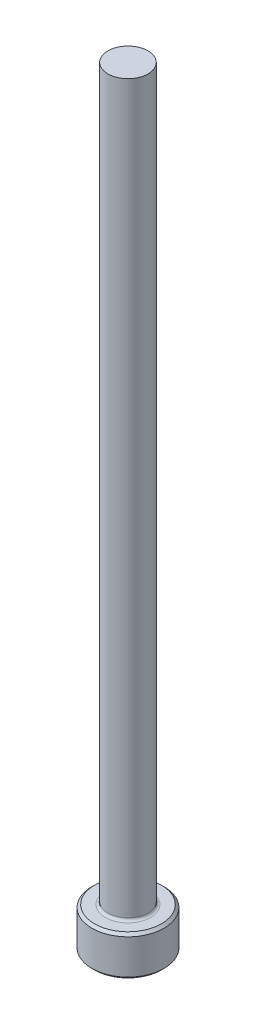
ISO-10303-21;
HEADER;
FILE_DESCRIPTION(('STEP AP214'),'2;1');
FILE_NAME('part.step','',(''),(''),'','','');
FILE_SCHEMA(('AUTOMOTIVE_DESIGN { 1 0 10303 214 1 1 1 1 }'));
ENDSEC;
DATA;
#1=APPLICATION_CONTEXT('core data for automotive mechanical design processes');
#2=APPLICATION_PROTOCOL_DEFINITION('international standard','automotive_design',2000,#1);
#3=PRODUCT_CONTEXT('',#1,'mechanical');
#4=PRODUCT('Part','Part','',(#3));
#5=PRODUCT_RELATED_PRODUCT_CATEGORY('part','',(#4));
#6=PRODUCT_DEFINITION_FORMATION('','',#4);
#7=PRODUCT_DEFINITION_CONTEXT('part definition',#1,'design');
#8=PRODUCT_DEFINITION('design','',#6,#7);
#9=PRODUCT_DEFINITION_SHAPE('','',#8);
#10=(LENGTH_UNIT() NAMED_UNIT(*) SI_UNIT(.MILLI.,.METRE.));
#11=(NAMED_UNIT(*) PLANE_ANGLE_UNIT() SI_UNIT($,.RADIAN.));
#12=(NAMED_UNIT(*) SI_UNIT($,.STERADIAN.) SOLID_ANGLE_UNIT());
#13=UNCERTAINTY_MEASURE_WITH_UNIT(LENGTH_MEASURE(1.E-05),#10,'distance_accuracy_value','');
#14=(GEOMETRIC_REPRESENTATION_CONTEXT(3) GLOBAL_UNCERTAINTY_ASSIGNED_CONTEXT((#13)) GLOBAL_UNIT_ASSIGNED_CONTEXT((#10,
#11,#12)) REPRESENTATION_CONTEXT('',''));
#15=CARTESIAN_POINT('',(0.,0.,0.));
#16=DIRECTION('',(0.,0.,1.));
#17=DIRECTION('',(1.,0.,0.));
#18=AXIS2_PLACEMENT_3D('',#15,#16,#17);
#19=CARTESIAN_POINT('',(0.,0.,0.));
#20=DIRECTION('',(0.,-1.,0.));
#21=DIRECTION('',(0.,0.,-1.));
#22=AXIS2_PLACEMENT_3D('',#19,#20,#21);
#23=PLANE('',#22);
#24=CARTESIAN_POINT('',(0.,0.,0.));
#25=DIRECTION('',(0.,-1.,0.));
#26=DIRECTION('',(0.,0.,-1.));
#27=AXIS2_PLACEMENT_3D('',#24,#25,#26);
#28=CIRCLE('',#27,3.3147);
#29=CARTESIAN_POINT('',(0.,0.,-3.3147));
#30=VERTEX_POINT('',#29);
#31=EDGE_CURVE('E46',#30,#30,#28,.T.);
#32=ORIENTED_EDGE('',*,*,#31,.T.);
#33=EDGE_LOOP('',(#32));
#34=FACE_BOUND('',#33,.T.);
#35=ADVANCED_FACE('F35',(#34),#23,.T.);
#36=CARTESIAN_POINT('',(0.,259.958771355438,0.));
#37=DIRECTION('',(0.,1.,0.));
#38=DIRECTION('',(0.,0.,1.));
#39=AXIS2_PLACEMENT_3D('',#36,#37,#38);
#40=CYLINDRICAL_SURFACE('',#39,3.56869999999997);
#41=CARTESIAN_POINT('',(0.,3.7084,0.));
#42=DIRECTION('',(0.,1.,0.));
#43=DIRECTION('',(0.,0.,1.));
#44=AXIS2_PLACEMENT_3D('',#41,#42,#43);
#45=CIRCLE('',#44,3.56869999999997);
#46=CARTESIAN_POINT('',(0.,3.7084,3.56869999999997));
#47=VERTEX_POINT('',#46);
#48=EDGE_CURVE('E50',#47,#47,#45,.F.);
#49=ORIENTED_EDGE('',*,*,#48,.T.);
#50=EDGE_LOOP('',(#49));
#51=FACE_BOUND('',#50,.T.);
#52=CARTESIAN_POINT('',(0.,0.253999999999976,0.));
#53=DIRECTION('',(0.,-1.,0.));
#54=DIRECTION('',(0.,0.,-1.));
#55=AXIS2_PLACEMENT_3D('',#52,#53,#54);
#56=CIRCLE('',#55,3.56869999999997);
#57=CARTESIAN_POINT('',(0.,0.253999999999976,-3.56869999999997));
#58=VERTEX_POINT('',#57);
#59=EDGE_CURVE('E55',#58,#58,#56,.F.);
#60=ORIENTED_EDGE('',*,*,#59,.T.);
#61=EDGE_LOOP('',(#60));
#62=FACE_BOUND('',#61,.T.);
#63=ADVANCED_FACE('F77',(#51,#62),#40,.T.);
#64=CARTESIAN_POINT('',(-3.56869999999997,3.9624,0.));
#65=DIRECTION('',(0.,1.,0.));
#66=DIRECTION('',(0.,0.,1.));
#67=AXIS2_PLACEMENT_3D('',#64,#65,#66);
#68=PLANE('',#67);
#69=CARTESIAN_POINT('',(0.,3.9624,0.));
#70=DIRECTION('',(0.,1.,0.));
#71=DIRECTION('',(0.,0.,1.));
#72=AXIS2_PLACEMENT_3D('',#69,#70,#71);
#73=CIRCLE('',#72,2.23773999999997);
#74=CARTESIAN_POINT('',(0.,3.9624,2.23773999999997));
#75=VERTEX_POINT('',#74);
#76=EDGE_CURVE('E10',#75,#75,#73,.F.);
#77=ORIENTED_EDGE('',*,*,#76,.T.);
#78=EDGE_LOOP('',(#77));
#79=FACE_BOUND('',#78,.T.);
#80=CARTESIAN_POINT('',(0.,3.9624,0.));
#81=DIRECTION('',(0.,1.,0.));
#82=DIRECTION('',(0.,0.,1.));
#83=AXIS2_PLACEMENT_3D('',#80,#81,#82);
#84=CIRCLE('',#83,3.31469999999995);
#85=CARTESIAN_POINT('',(0.,3.9624,3.31469999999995));
#86=VERTEX_POINT('',#85);
#87=EDGE_CURVE('E58',#86,#86,#84,.T.);
#88=ORIENTED_EDGE('',*,*,#87,.T.);
#89=EDGE_LOOP('',(#88));
#90=FACE_BOUND('',#89,.T.);
#91=ADVANCED_FACE('F69',(#79,#90),#68,.T.);
#92=CARTESIAN_POINT('',(0.,259.958771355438,0.));
#93=DIRECTION('',(0.,1.,0.));
#94=DIRECTION('',(0.,0.,1.));
#95=AXIS2_PLACEMENT_3D('',#92,#93,#94);
#96=CYLINDRICAL_SURFACE('',#95,1.98373999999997);
#97=CARTESIAN_POINT('',(0.,4.21640000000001,0.));
#98=DIRECTION('',(0.,1.,0.));
#99=DIRECTION('',(0.,0.,1.));
#100=AXIS2_PLACEMENT_3D('',#97,#98,#99);
#101=CIRCLE('',#100,1.98373999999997);
#102=CARTESIAN_POINT('',(0.,4.21640000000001,1.98373999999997));
#103=VERTEX_POINT('',#102);
#104=EDGE_CURVE('E42',#103,#103,#101,.T.);
#105=ORIENTED_EDGE('',*,*,#104,.T.);
#106=EDGE_LOOP('',(#105));
#107=FACE_BOUND('',#106,.T.);
#108=CARTESIAN_POINT('',(0.,76.2,0.));
#109=DIRECTION('',(0.,1.,0.));
#110=DIRECTION('',(0.,0.,1.));
#111=AXIS2_PLACEMENT_3D('',#108,#109,#110);
#112=CIRCLE('',#111,1.98373999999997);
#113=CARTESIAN_POINT('',(0.,76.2,1.98373999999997));
#114=VERTEX_POINT('',#113);
#115=EDGE_CURVE('E61',#114,#114,#112,.T.);
#116=ORIENTED_EDGE('',*,*,#115,.F.);
#117=EDGE_LOOP('',(#116));
#118=FACE_BOUND('',#117,.T.);
#119=ADVANCED_FACE('F67',(#107,#118),#96,.T.);
#120=CARTESIAN_POINT('',(-1.98373999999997,76.2,0.));
#121=DIRECTION('',(0.,1.,0.));
#122=DIRECTION('',(0.,0.,1.));
#123=AXIS2_PLACEMENT_3D('',#120,#121,#122);
#124=PLANE('',#123);
#125=ORIENTED_EDGE('',*,*,#115,.T.);
#126=EDGE_LOOP('',(#125));
#127=FACE_BOUND('',#126,.T.);
#128=ADVANCED_FACE('F65',(#127),#124,.T.);
#129=CARTESIAN_POINT('',(0.,3.96239999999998,0.));
#130=DIRECTION('',(0.,-1.,0.));
#131=DIRECTION('',(0.,0.,-1.));
#132=AXIS2_PLACEMENT_3D('',#129,#130,#131);
#133=CONICAL_SURFACE('',#132,3.31469999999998,0.78539816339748);
#134=ORIENTED_EDGE('',*,*,#48,.F.);
#135=EDGE_LOOP('',(#134));
#136=FACE_BOUND('',#135,.T.);
#137=ORIENTED_EDGE('',*,*,#87,.F.);
#138=EDGE_LOOP('',(#137));
#139=FACE_BOUND('',#138,.T.);
#140=ADVANCED_FACE('F75',(#136,#139),#133,.T.);
#141=CARTESIAN_POINT('',(0.,0.253999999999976,0.));
#142=DIRECTION('',(0.,1.,0.));
#143=DIRECTION('',(0.,0.,1.));
#144=AXIS2_PLACEMENT_3D('',#141,#142,#143);
#145=CONICAL_SURFACE('',#144,3.56869999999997,0.785398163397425);
#146=ORIENTED_EDGE('',*,*,#31,.F.);
#147=EDGE_LOOP('',(#146));
#148=FACE_BOUND('',#147,.T.);
#149=ORIENTED_EDGE('',*,*,#59,.F.);
#150=EDGE_LOOP('',(#149));
#151=FACE_BOUND('',#150,.T.);
#152=ADVANCED_FACE('F89',(#148,#151),#145,.T.);
#153=CARTESIAN_POINT('',(0.,4.21640000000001,0.));
#154=DIRECTION('',(0.,1.,0.));
#155=DIRECTION('',(0.,0.,1.));
#156=AXIS2_PLACEMENT_3D('',#153,#154,#155);
#157=TOROIDAL_SURFACE('',#156,2.23773999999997,0.254);
#158=ORIENTED_EDGE('',*,*,#76,.F.);
#159=EDGE_LOOP('',(#158));
#160=FACE_BOUND('',#159,.T.);
#161=ORIENTED_EDGE('',*,*,#104,.F.);
#162=EDGE_LOOP('',(#161));
#163=FACE_BOUND('',#162,.T.);
#164=ADVANCED_FACE('F37',(#160,#163),#157,.F.);
#165=CLOSED_SHELL('',(#35,#63,#91,#119,#128,#140,#152,#164));
#166=MANIFOLD_SOLID_BREP('B2',#165);
#167=ADVANCED_BREP_SHAPE_REPRESENTATION('',(#18,#166),#14);
#168=SHAPE_DEFINITION_REPRESENTATION(#9,#167);
ENDSEC;
END-ISO-10303-21;
